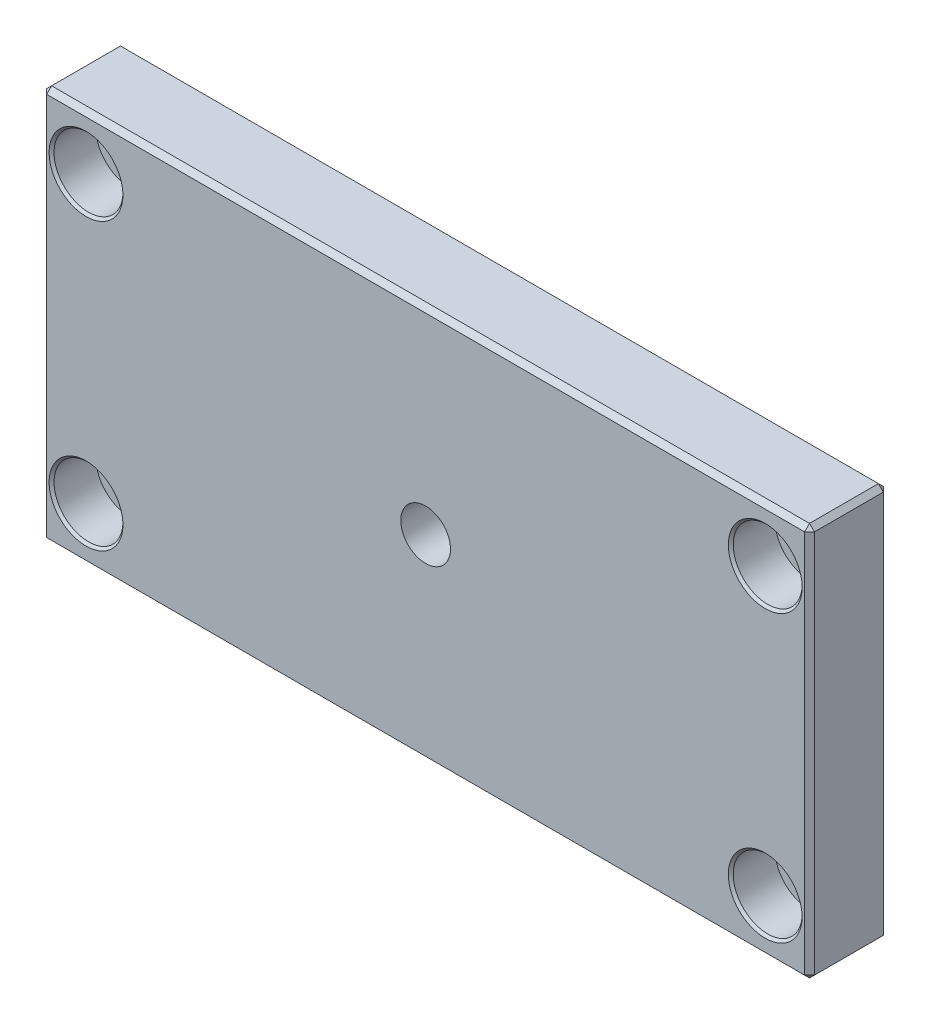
ISO-10303-21;
HEADER;
FILE_DESCRIPTION(('STEP AP214'),'2;1');
FILE_NAME('part.step','',(''),(''),'','','');
FILE_SCHEMA(('AUTOMOTIVE_DESIGN { 1 0 10303 214 1 1 1 1 }'));
ENDSEC;
DATA;
#1=APPLICATION_CONTEXT('core data for automotive mechanical design processes');
#2=APPLICATION_PROTOCOL_DEFINITION('international standard','automotive_design',2000,#1);
#3=PRODUCT_CONTEXT('',#1,'mechanical');
#4=PRODUCT('Part','Part','',(#3));
#5=PRODUCT_RELATED_PRODUCT_CATEGORY('part','',(#4));
#6=PRODUCT_DEFINITION_FORMATION('','',#4);
#7=PRODUCT_DEFINITION_CONTEXT('part definition',#1,'design');
#8=PRODUCT_DEFINITION('design','',#6,#7);
#9=PRODUCT_DEFINITION_SHAPE('','',#8);
#10=(LENGTH_UNIT() NAMED_UNIT(*) SI_UNIT(.MILLI.,.METRE.));
#11=(NAMED_UNIT(*) PLANE_ANGLE_UNIT() SI_UNIT($,.RADIAN.));
#12=(NAMED_UNIT(*) SI_UNIT($,.STERADIAN.) SOLID_ANGLE_UNIT());
#13=UNCERTAINTY_MEASURE_WITH_UNIT(LENGTH_MEASURE(1.E-05),#10,'distance_accuracy_value','');
#14=(GEOMETRIC_REPRESENTATION_CONTEXT(3) GLOBAL_UNCERTAINTY_ASSIGNED_CONTEXT((#13)) GLOBAL_UNIT_ASSIGNED_CONTEXT((#10,
#11,#12)) REPRESENTATION_CONTEXT('',''));
#15=CARTESIAN_POINT('',(0.,0.,0.));
#16=DIRECTION('',(0.,0.,1.));
#17=DIRECTION('',(1.,0.,0.));
#18=AXIS2_PLACEMENT_3D('',#15,#16,#17);
#19=CARTESIAN_POINT('',(0.499999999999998,0.5,15.));
#20=DIRECTION('',(-0.577350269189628,-0.577350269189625,0.577350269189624));
#21=DIRECTION('',(0.707106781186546,-0.707106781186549,0.));
#22=AXIS2_PLACEMENT_3D('',#19,#20,#21);
#23=PLANE('',#22);
#24=DIRECTION('',(0.707106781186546,0.,0.707106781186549));
#25=VECTOR('',#24,1.);
#26=CARTESIAN_POINT('',(0.499999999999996,1.,15.5));
#27=LINE('',#26,#25);
#28=CARTESIAN_POINT('',(0.,1.,15.));
#29=VERTEX_POINT('',#28);
#30=CARTESIAN_POINT('',(0.999999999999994,1.,16.));
#31=VERTEX_POINT('',#30);
#32=EDGE_CURVE('E122',#29,#31,#27,.T.);
#33=ORIENTED_EDGE('',*,*,#32,.F.);
#34=DIRECTION('',(0.707106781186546,-0.707106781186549,0.));
#35=VECTOR('',#34,1.);
#36=CARTESIAN_POINT('',(0.499999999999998,0.5,15.));
#37=LINE('',#36,#35);
#38=CARTESIAN_POINT('',(0.999999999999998,0.,15.));
#39=VERTEX_POINT('',#38);
#40=EDGE_CURVE('E105',#39,#29,#37,.F.);
#41=ORIENTED_EDGE('',*,*,#40,.F.);
#42=DIRECTION('',(0.,-0.707106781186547,-0.707106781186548));
#43=VECTOR('',#42,1.);
#44=CARTESIAN_POINT('',(1.,0.499999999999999,15.5));
#45=LINE('',#44,#43);
#46=EDGE_CURVE('E181',#31,#39,#45,.T.);
#47=ORIENTED_EDGE('',*,*,#46,.F.);
#48=EDGE_LOOP('',(#33,#41,#47));
#49=FACE_BOUND('',#48,.T.);
#50=ADVANCED_FACE('F17',(#49),#23,.T.);
#51=CARTESIAN_POINT('',(155.5,0.499999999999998,15.));
#52=DIRECTION('',(0.577350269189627,-0.577350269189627,0.577350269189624));
#53=DIRECTION('',(0.707106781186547,0.707106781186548,0.));
#54=AXIS2_PLACEMENT_3D('',#51,#52,#53);
#55=PLANE('',#54);
#56=DIRECTION('',(0.707106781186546,0.,-0.707106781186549));
#57=VECTOR('',#56,1.);
#58=CARTESIAN_POINT('',(155.5,1.,15.5));
#59=LINE('',#58,#57);
#60=CARTESIAN_POINT('',(155.,0.999999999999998,16.));
#61=VERTEX_POINT('',#60);
#62=CARTESIAN_POINT('',(156.,0.999999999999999,15.));
#63=VERTEX_POINT('',#62);
#64=EDGE_CURVE('E177',#61,#63,#59,.T.);
#65=ORIENTED_EDGE('',*,*,#64,.F.);
#66=DIRECTION('',(0.,-0.707106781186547,-0.707106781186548));
#67=VECTOR('',#66,1.);
#68=CARTESIAN_POINT('',(155.,0.499999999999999,15.5));
#69=LINE('',#68,#67);
#70=CARTESIAN_POINT('',(155.,0.,15.));
#71=VERTEX_POINT('',#70);
#72=EDGE_CURVE('E179',#71,#61,#69,.F.);
#73=ORIENTED_EDGE('',*,*,#72,.F.);
#74=DIRECTION('',(0.707106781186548,0.707106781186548,0.));
#75=VECTOR('',#74,1.);
#76=CARTESIAN_POINT('',(155.5,0.499999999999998,15.));
#77=LINE('',#76,#75);
#78=EDGE_CURVE('E187',#63,#71,#77,.F.);
#79=ORIENTED_EDGE('',*,*,#78,.F.);
#80=EDGE_LOOP('',(#65,#73,#79));
#81=FACE_BOUND('',#80,.T.);
#82=ADVANCED_FACE('F296',(#81),#55,.T.);
#83=CARTESIAN_POINT('',(155.5,79.5,15.));
#84=DIRECTION('',(0.577350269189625,0.577350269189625,0.577350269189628));
#85=DIRECTION('',(0.707106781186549,0.,-0.707106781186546));
#86=AXIS2_PLACEMENT_3D('',#83,#84,#85);
#87=PLANE('',#86);
#88=DIRECTION('',(0.,-0.707106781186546,0.707106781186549));
#89=VECTOR('',#88,1.);
#90=CARTESIAN_POINT('',(155.,79.5,15.5));
#91=LINE('',#90,#89);
#92=CARTESIAN_POINT('',(155.,79.,16.));
#93=VERTEX_POINT('',#92);
#94=CARTESIAN_POINT('',(155.,80.,15.));
#95=VERTEX_POINT('',#94);
#96=EDGE_CURVE('E173',#93,#95,#91,.F.);
#97=ORIENTED_EDGE('',*,*,#96,.F.);
#98=DIRECTION('',(0.707106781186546,0.,-0.707106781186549));
#99=VECTOR('',#98,1.);
#100=CARTESIAN_POINT('',(155.5,79.,15.5));
#101=LINE('',#100,#99);
#102=CARTESIAN_POINT('',(156.,79.,15.));
#103=VERTEX_POINT('',#102);
#104=EDGE_CURVE('E175',#103,#93,#101,.F.);
#105=ORIENTED_EDGE('',*,*,#104,.F.);
#106=DIRECTION('',(-0.707106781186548,0.707106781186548,0.));
#107=VECTOR('',#106,1.);
#108=CARTESIAN_POINT('',(155.5,79.5,15.));
#109=LINE('',#108,#107);
#110=EDGE_CURVE('E133',#95,#103,#109,.F.);
#111=ORIENTED_EDGE('',*,*,#110,.F.);
#112=EDGE_LOOP('',(#97,#105,#111));
#113=FACE_BOUND('',#112,.T.);
#114=ADVANCED_FACE('F495',(#113),#87,.T.);
#115=CARTESIAN_POINT('',(0.,79.,15.));
#116=DIRECTION('',(-0.577350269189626,0.577350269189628,0.577350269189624));
#117=DIRECTION('',(-0.707106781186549,-0.707106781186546,0.));
#118=AXIS2_PLACEMENT_3D('',#115,#116,#117);
#119=PLANE('',#118);
#120=DIRECTION('',(-0.707106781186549,-0.707106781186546,0.));
#121=VECTOR('',#120,1.);
#122=CARTESIAN_POINT('',(0.499999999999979,79.5,15.));
#123=LINE('',#122,#121);
#124=CARTESIAN_POINT('',(0.,79.,15.));
#125=VERTEX_POINT('',#124);
#126=CARTESIAN_POINT('',(0.999999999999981,80.,15.));
#127=VERTEX_POINT('',#126);
#128=EDGE_CURVE('E125',#125,#127,#123,.F.);
#129=ORIENTED_EDGE('',*,*,#128,.F.);
#130=DIRECTION('',(0.707106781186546,0.,0.707106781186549));
#131=VECTOR('',#130,1.);
#132=CARTESIAN_POINT('',(0.499999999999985,79.,15.5));
#133=LINE('',#132,#131);
#134=CARTESIAN_POINT('',(0.999999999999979,79.,16.));
#135=VERTEX_POINT('',#134);
#136=EDGE_CURVE('E112',#135,#125,#133,.F.);
#137=ORIENTED_EDGE('',*,*,#136,.F.);
#138=DIRECTION('',(0.,-0.707106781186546,0.707106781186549));
#139=VECTOR('',#138,1.);
#140=CARTESIAN_POINT('',(0.99999999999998,79.5,15.5));
#141=LINE('',#140,#139);
#142=EDGE_CURVE('E127',#127,#135,#141,.T.);
#143=ORIENTED_EDGE('',*,*,#142,.F.);
#144=EDGE_LOOP('',(#129,#137,#143));
#145=FACE_BOUND('',#144,.T.);
#146=ADVANCED_FACE('F126',(#145),#119,.T.);
#147=CARTESIAN_POINT('',(0.499999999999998,0.5,0.));
#148=DIRECTION('',(-0.707106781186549,-0.707106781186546,0.));
#149=DIRECTION('',(0.707106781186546,-0.707106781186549,0.));
#150=AXIS2_PLACEMENT_3D('',#147,#148,#149);
#151=PLANE('',#150);
#152=DIRECTION('',(0.707106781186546,-0.707106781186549,0.));
#153=VECTOR('',#152,1.);
#154=CARTESIAN_POINT('',(0.499999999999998,0.5,1.));
#155=LINE('',#154,#153);
#156=CARTESIAN_POINT('',(0.,1.,1.));
#157=VERTEX_POINT('',#156);
#158=CARTESIAN_POINT('',(0.999999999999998,0.,1.));
#159=VERTEX_POINT('',#158);
#160=EDGE_CURVE('E189',#157,#159,#155,.T.);
#161=ORIENTED_EDGE('',*,*,#160,.T.);
#162=DIRECTION('',(0.,0.,-1.));
#163=VECTOR('',#162,1.);
#164=CARTESIAN_POINT('',(1.,0.,0.));
#165=LINE('',#164,#163);
#166=EDGE_CURVE('E277',#39,#159,#165,.T.);
#167=ORIENTED_EDGE('',*,*,#166,.F.);
#168=ORIENTED_EDGE('',*,*,#40,.T.);
#169=DIRECTION('',(0.,0.,1.));
#170=VECTOR('',#169,1.);
#171=CARTESIAN_POINT('',(0.,1.,0.));
#172=LINE('',#171,#170);
#173=EDGE_CURVE('E141',#157,#29,#172,.T.);
#174=ORIENTED_EDGE('',*,*,#173,.F.);
#175=EDGE_LOOP('',(#161,#167,#168,#174));
#176=FACE_BOUND('',#175,.T.);
#177=ADVANCED_FACE('F304',(#176),#151,.T.);
#178=CARTESIAN_POINT('',(155.5,0.499999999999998,0.));
#179=DIRECTION('',(0.707106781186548,-0.707106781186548,0.));
#180=DIRECTION('',(0.707106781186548,0.707106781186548,0.));
#181=AXIS2_PLACEMENT_3D('',#178,#179,#180);
#182=PLANE('',#181);
#183=DIRECTION('',(0.707106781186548,0.707106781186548,0.));
#184=VECTOR('',#183,1.);
#185=CARTESIAN_POINT('',(155.5,0.499999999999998,1.));
#186=LINE('',#185,#184);
#187=CARTESIAN_POINT('',(155.,0.,1.));
#188=VERTEX_POINT('',#187);
#189=CARTESIAN_POINT('',(156.,0.999999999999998,1.));
#190=VERTEX_POINT('',#189);
#191=EDGE_CURVE('E134',#188,#190,#186,.T.);
#192=ORIENTED_EDGE('',*,*,#191,.T.);
#193=DIRECTION('',(0.,0.,-1.));
#194=VECTOR('',#193,1.);
#195=CARTESIAN_POINT('',(156.,1.,0.));
#196=LINE('',#195,#194);
#197=EDGE_CURVE('E268',#63,#190,#196,.T.);
#198=ORIENTED_EDGE('',*,*,#197,.F.);
#199=ORIENTED_EDGE('',*,*,#78,.T.);
#200=DIRECTION('',(0.,0.,-1.));
#201=VECTOR('',#200,1.);
#202=CARTESIAN_POINT('',(155.,0.,0.));
#203=LINE('',#202,#201);
#204=EDGE_CURVE('E143',#188,#71,#203,.F.);
#205=ORIENTED_EDGE('',*,*,#204,.F.);
#206=EDGE_LOOP('',(#192,#198,#199,#205));
#207=FACE_BOUND('',#206,.T.);
#208=ADVANCED_FACE('F488',(#207),#182,.T.);
#209=CARTESIAN_POINT('',(0.499999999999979,79.5,0.));
#210=DIRECTION('',(-0.707106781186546,0.707106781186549,0.));
#211=DIRECTION('',(-0.707106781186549,-0.707106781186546,0.));
#212=AXIS2_PLACEMENT_3D('',#209,#210,#211);
#213=PLANE('',#212);
#214=DIRECTION('',(-0.707106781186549,-0.707106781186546,0.));
#215=VECTOR('',#214,1.);
#216=CARTESIAN_POINT('',(0.749999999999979,79.75,0.999999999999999));
#217=LINE('',#216,#215);
#218=CARTESIAN_POINT('',(0.,79.,0.999999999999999));
#219=VERTEX_POINT('',#218);
#220=CARTESIAN_POINT('',(0.999999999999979,80.,1.));
#221=VERTEX_POINT('',#220);
#222=EDGE_CURVE('E147',#219,#221,#217,.F.);
#223=ORIENTED_EDGE('',*,*,#222,.F.);
#224=DIRECTION('',(0.,0.,1.));
#225=VECTOR('',#224,1.);
#226=CARTESIAN_POINT('',(0.,79.,0.));
#227=LINE('',#226,#225);
#228=EDGE_CURVE('E139',#125,#219,#227,.F.);
#229=ORIENTED_EDGE('',*,*,#228,.F.);
#230=ORIENTED_EDGE('',*,*,#128,.T.);
#231=DIRECTION('',(0.,0.,1.));
#232=VECTOR('',#231,1.);
#233=CARTESIAN_POINT('',(0.999999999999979,80.,0.));
#234=LINE('',#233,#232);
#235=EDGE_CURVE('E265',#221,#127,#234,.T.);
#236=ORIENTED_EDGE('',*,*,#235,.F.);
#237=EDGE_LOOP('',(#223,#229,#230,#236));
#238=FACE_BOUND('',#237,.T.);
#239=ADVANCED_FACE('F146',(#238),#213,.T.);
#240=CARTESIAN_POINT('',(155.5,79.5,0.));
#241=DIRECTION('',(0.707106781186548,0.707106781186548,0.));
#242=DIRECTION('',(-0.707106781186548,0.707106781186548,0.));
#243=AXIS2_PLACEMENT_3D('',#240,#241,#242);
#244=PLANE('',#243);
#245=DIRECTION('',(-0.707106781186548,0.707106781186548,0.));
#246=VECTOR('',#245,1.);
#247=CARTESIAN_POINT('',(155.5,79.5,1.));
#248=LINE('',#247,#246);
#249=CARTESIAN_POINT('',(156.,79.,1.));
#250=VERTEX_POINT('',#249);
#251=CARTESIAN_POINT('',(155.,80.,0.999999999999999));
#252=VERTEX_POINT('',#251);
#253=EDGE_CURVE('E123',#250,#252,#248,.T.);
#254=ORIENTED_EDGE('',*,*,#253,.T.);
#255=DIRECTION('',(0.,0.,1.));
#256=VECTOR('',#255,1.);
#257=CARTESIAN_POINT('',(155.,80.,0.));
#258=LINE('',#257,#256);
#259=EDGE_CURVE('E259',#95,#252,#258,.F.);
#260=ORIENTED_EDGE('',*,*,#259,.F.);
#261=ORIENTED_EDGE('',*,*,#110,.T.);
#262=DIRECTION('',(0.,0.,-1.));
#263=VECTOR('',#262,1.);
#264=CARTESIAN_POINT('',(156.,79.,0.));
#265=LINE('',#264,#263);
#266=EDGE_CURVE('E274',#250,#103,#265,.F.);
#267=ORIENTED_EDGE('',*,*,#266,.F.);
#268=EDGE_LOOP('',(#254,#260,#261,#267));
#269=FACE_BOUND('',#268,.T.);
#270=ADVANCED_FACE('F370',(#269),#244,.T.);
#271=CARTESIAN_POINT('',(0.499999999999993,20.,15.5));
#272=DIRECTION('',(-0.707106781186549,0.,0.707106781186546));
#273=DIRECTION('',(0.707106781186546,0.,0.707106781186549));
#274=AXIS2_PLACEMENT_3D('',#271,#272,#273);
#275=PLANE('',#274);
#276=ORIENTED_EDGE('',*,*,#32,.T.);
#277=DIRECTION('',(0.,1.,0.));
#278=VECTOR('',#277,1.);
#279=CARTESIAN_POINT('',(0.999999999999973,40.,16.));
#280=LINE('',#279,#278);
#281=EDGE_CURVE('E118',#135,#31,#280,.F.);
#282=ORIENTED_EDGE('',*,*,#281,.F.);
#283=ORIENTED_EDGE('',*,*,#136,.T.);
#284=DIRECTION('',(0.,1.,0.));
#285=VECTOR('',#284,1.);
#286=CARTESIAN_POINT('',(0.,0.,15.));
#287=LINE('',#286,#285);
#288=EDGE_CURVE('E116',#29,#125,#287,.T.);
#289=ORIENTED_EDGE('',*,*,#288,.F.);
#290=EDGE_LOOP('',(#276,#282,#283,#289));
#291=FACE_BOUND('',#290,.T.);
#292=ADVANCED_FACE('F114',(#291),#275,.T.);
#293=CARTESIAN_POINT('',(117.,0.499999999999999,15.5));
#294=DIRECTION('',(0.,-0.707106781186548,0.707106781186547));
#295=DIRECTION('',(0.,-0.707106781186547,-0.707106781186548));
#296=AXIS2_PLACEMENT_3D('',#293,#294,#295);
#297=PLANE('',#296);
#298=ORIENTED_EDGE('',*,*,#72,.T.);
#299=DIRECTION('',(1.,0.,0.));
#300=VECTOR('',#299,1.);
#301=CARTESIAN_POINT('',(78.,1.,16.));
#302=LINE('',#301,#300);
#303=EDGE_CURVE('E251',#31,#61,#302,.T.);
#304=ORIENTED_EDGE('',*,*,#303,.F.);
#305=ORIENTED_EDGE('',*,*,#46,.T.);
#306=DIRECTION('',(1.,0.,0.));
#307=VECTOR('',#306,1.);
#308=CARTESIAN_POINT('',(156.,0.,15.));
#309=LINE('',#308,#307);
#310=EDGE_CURVE('E280',#71,#39,#309,.F.);
#311=ORIENTED_EDGE('',*,*,#310,.F.);
#312=EDGE_LOOP('',(#298,#304,#305,#311));
#313=FACE_BOUND('',#312,.T.);
#314=ADVANCED_FACE('F301',(#313),#297,.T.);
#315=CARTESIAN_POINT('',(155.5,60.,15.5));
#316=DIRECTION('',(0.707106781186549,0.,0.707106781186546));
#317=DIRECTION('',(0.707106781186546,0.,-0.707106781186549));
#318=AXIS2_PLACEMENT_3D('',#315,#316,#317);
#319=PLANE('',#318);
#320=ORIENTED_EDGE('',*,*,#104,.T.);
#321=DIRECTION('',(0.,1.,0.));
#322=VECTOR('',#321,1.);
#323=CARTESIAN_POINT('',(155.,40.,16.));
#324=LINE('',#323,#322);
#325=EDGE_CURVE('E246',#61,#93,#324,.T.);
#326=ORIENTED_EDGE('',*,*,#325,.F.);
#327=ORIENTED_EDGE('',*,*,#64,.T.);
#328=DIRECTION('',(0.,1.,0.));
#329=VECTOR('',#328,1.);
#330=CARTESIAN_POINT('',(156.,80.,15.));
#331=LINE('',#330,#329);
#332=EDGE_CURVE('E271',#103,#63,#331,.F.);
#333=ORIENTED_EDGE('',*,*,#332,.F.);
#334=EDGE_LOOP('',(#320,#326,#327,#333));
#335=FACE_BOUND('',#334,.T.);
#336=ADVANCED_FACE('F475',(#335),#319,.T.);
#337=CARTESIAN_POINT('',(39.,79.5,15.5));
#338=DIRECTION('',(0.,0.707106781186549,0.707106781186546));
#339=DIRECTION('',(0.,-0.707106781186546,0.707106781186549));
#340=AXIS2_PLACEMENT_3D('',#337,#338,#339);
#341=PLANE('',#340);
#342=ORIENTED_EDGE('',*,*,#142,.T.);
#343=DIRECTION('',(1.,0.,0.));
#344=VECTOR('',#343,1.);
#345=CARTESIAN_POINT('',(78.,79.,16.));
#346=LINE('',#345,#344);
#347=EDGE_CURVE('E243',#93,#135,#346,.F.);
#348=ORIENTED_EDGE('',*,*,#347,.F.);
#349=ORIENTED_EDGE('',*,*,#96,.T.);
#350=DIRECTION('',(1.,0.,0.));
#351=VECTOR('',#350,1.);
#352=CARTESIAN_POINT('',(0.,80.,15.));
#353=LINE('',#352,#351);
#354=EDGE_CURVE('E262',#127,#95,#353,.T.);
#355=ORIENTED_EDGE('',*,*,#354,.F.);
#356=EDGE_LOOP('',(#342,#348,#349,#355));
#357=FACE_BOUND('',#356,.T.);
#358=ADVANCED_FACE('F471',(#357),#341,.T.);
#359=CARTESIAN_POINT('',(147.,11.,16.0000000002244));
#360=DIRECTION('',(0.,0.,1.));
#361=DIRECTION('',(1.,0.,0.));
#362=AXIS2_PLACEMENT_3D('',#359,#360,#361);
#363=CONICAL_SURFACE('',#362,7.49999999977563,0.785398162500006);
#364=CARTESIAN_POINT('',(147.,11.,16.0000000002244));
#365=DIRECTION('',(0.,0.,1.));
#366=DIRECTION('',(1.,0.,0.));
#367=AXIS2_PLACEMENT_3D('',#364,#365,#366);
#368=CIRCLE('',#367,7.49999999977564);
#369=CARTESIAN_POINT('',(154.499999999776,11.,16.0000000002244));
#370=VERTEX_POINT('',#369);
#371=EDGE_CURVE('E20',#370,#370,#368,.F.);
#372=ORIENTED_EDGE('',*,*,#371,.F.);
#373=EDGE_LOOP('',(#372));
#374=FACE_BOUND('',#373,.T.);
#375=CARTESIAN_POINT('',(147.,11.,15.5));
#376=DIRECTION('',(0.,0.,1.));
#377=DIRECTION('',(1.,0.,0.));
#378=AXIS2_PLACEMENT_3D('',#375,#376,#377);
#379=CIRCLE('',#378,7.);
#380=CARTESIAN_POINT('',(154.,11.,15.5));
#381=VERTEX_POINT('',#380);
#382=EDGE_CURVE('E165',#381,#381,#379,.F.);
#383=ORIENTED_EDGE('',*,*,#382,.T.);
#384=EDGE_LOOP('',(#383));
#385=FACE_BOUND('',#384,.T.);
#386=ADVANCED_FACE('F467',(#374,#385),#363,.F.);
#387=CARTESIAN_POINT('',(9.00000000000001,11.,16.0000000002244));
#388=DIRECTION('',(0.,0.,1.));
#389=DIRECTION('',(1.,0.,0.));
#390=AXIS2_PLACEMENT_3D('',#387,#388,#389);
#391=CONICAL_SURFACE('',#390,7.49999999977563,0.785398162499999);
#392=CARTESIAN_POINT('',(9.00000000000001,11.,16.0000000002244));
#393=DIRECTION('',(0.,0.,1.));
#394=DIRECTION('',(1.,0.,0.));
#395=AXIS2_PLACEMENT_3D('',#392,#393,#394);
#396=CIRCLE('',#395,7.49999999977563);
#397=CARTESIAN_POINT('',(16.4999999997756,11.,16.0000000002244));
#398=VERTEX_POINT('',#397);
#399=EDGE_CURVE('E238',#398,#398,#396,.F.);
#400=ORIENTED_EDGE('',*,*,#399,.F.);
#401=EDGE_LOOP('',(#400));
#402=FACE_BOUND('',#401,.T.);
#403=CARTESIAN_POINT('',(9.00000000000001,11.,15.5));
#404=DIRECTION('',(0.,0.,1.));
#405=DIRECTION('',(1.,0.,0.));
#406=AXIS2_PLACEMENT_3D('',#403,#404,#405);
#407=CIRCLE('',#406,7.);
#408=CARTESIAN_POINT('',(16.,11.,15.5));
#409=VERTEX_POINT('',#408);
#410=EDGE_CURVE('E149',#409,#409,#407,.F.);
#411=ORIENTED_EDGE('',*,*,#410,.T.);
#412=EDGE_LOOP('',(#411));
#413=FACE_BOUND('',#412,.T.);
#414=ADVANCED_FACE('F463',(#402,#413),#391,.F.);
#415=CARTESIAN_POINT('',(147.,69.,16.0000000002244));
#416=DIRECTION('',(0.,0.,1.));
#417=DIRECTION('',(1.,0.,0.));
#418=AXIS2_PLACEMENT_3D('',#415,#416,#417);
#419=CONICAL_SURFACE('',#418,7.49999999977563,0.785398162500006);
#420=CARTESIAN_POINT('',(147.,69.,16.0000000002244));
#421=DIRECTION('',(0.,0.,1.));
#422=DIRECTION('',(1.,0.,0.));
#423=AXIS2_PLACEMENT_3D('',#420,#421,#422);
#424=CIRCLE('',#423,7.49999999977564);
#425=CARTESIAN_POINT('',(154.499999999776,69.,16.0000000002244));
#426=VERTEX_POINT('',#425);
#427=EDGE_CURVE('E236',#426,#426,#424,.F.);
#428=ORIENTED_EDGE('',*,*,#427,.F.);
#429=EDGE_LOOP('',(#428));
#430=FACE_BOUND('',#429,.T.);
#431=CARTESIAN_POINT('',(147.,69.,15.5));
#432=DIRECTION('',(0.,0.,1.));
#433=DIRECTION('',(1.,0.,0.));
#434=AXIS2_PLACEMENT_3D('',#431,#432,#433);
#435=CIRCLE('',#434,7.);
#436=CARTESIAN_POINT('',(154.,69.,15.5));
#437=VERTEX_POINT('',#436);
#438=EDGE_CURVE('E153',#437,#437,#435,.F.);
#439=ORIENTED_EDGE('',*,*,#438,.T.);
#440=EDGE_LOOP('',(#439));
#441=FACE_BOUND('',#440,.T.);
#442=ADVANCED_FACE('F455',(#430,#441),#419,.F.);
#443=CARTESIAN_POINT('',(9.00000000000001,69.,16.0000000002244));
#444=DIRECTION('',(0.,0.,1.));
#445=DIRECTION('',(1.,0.,0.));
#446=AXIS2_PLACEMENT_3D('',#443,#444,#445);
#447=CONICAL_SURFACE('',#446,7.49999999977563,0.785398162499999);
#448=CARTESIAN_POINT('',(9.00000000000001,69.,16.0000000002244));
#449=DIRECTION('',(0.,0.,1.));
#450=DIRECTION('',(1.,0.,0.));
#451=AXIS2_PLACEMENT_3D('',#448,#449,#450);
#452=CIRCLE('',#451,7.49999999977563);
#453=CARTESIAN_POINT('',(16.4999999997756,69.,16.0000000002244));
#454=VERTEX_POINT('',#453);
#455=EDGE_CURVE('E233',#454,#454,#452,.F.);
#456=ORIENTED_EDGE('',*,*,#455,.F.);
#457=EDGE_LOOP('',(#456));
#458=FACE_BOUND('',#457,.T.);
#459=CARTESIAN_POINT('',(9.00000000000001,69.,15.5));
#460=DIRECTION('',(0.,0.,1.));
#461=DIRECTION('',(1.,0.,0.));
#462=AXIS2_PLACEMENT_3D('',#459,#460,#461);
#463=CIRCLE('',#462,7.);
#464=CARTESIAN_POINT('',(16.,69.,15.5));
#465=VERTEX_POINT('',#464);
#466=EDGE_CURVE('E160',#465,#465,#463,.F.);
#467=ORIENTED_EDGE('',*,*,#466,.T.);
#468=EDGE_LOOP('',(#467));
#469=FACE_BOUND('',#468,.T.);
#470=ADVANCED_FACE('F445',(#458,#469),#447,.F.);
#471=CARTESIAN_POINT('',(147.,11.,11.5));
#472=DIRECTION('',(0.,0.,1.));
#473=DIRECTION('',(1.,0.,0.));
#474=AXIS2_PLACEMENT_3D('',#471,#472,#473);
#475=CYLINDRICAL_SURFACE('',#474,7.);
#476=ORIENTED_EDGE('',*,*,#382,.F.);
#477=EDGE_LOOP('',(#476));
#478=FACE_BOUND('',#477,.T.);
#479=CARTESIAN_POINT('',(147.,11.,7.));
#480=DIRECTION('',(0.,0.,1.));
#481=DIRECTION('',(1.,0.,0.));
#482=AXIS2_PLACEMENT_3D('',#479,#480,#481);
#483=CIRCLE('',#482,7.);
#484=CARTESIAN_POINT('',(154.,11.,7.));
#485=VERTEX_POINT('',#484);
#486=EDGE_CURVE('E230',#485,#485,#483,.T.);
#487=ORIENTED_EDGE('',*,*,#486,.F.);
#488=EDGE_LOOP('',(#487));
#489=FACE_BOUND('',#488,.T.);
#490=ADVANCED_FACE('F442',(#478,#489),#475,.F.);
#491=CARTESIAN_POINT('',(9.00000000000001,69.,11.5));
#492=DIRECTION('',(0.,0.,1.));
#493=DIRECTION('',(1.,0.,0.));
#494=AXIS2_PLACEMENT_3D('',#491,#492,#493);
#495=CYLINDRICAL_SURFACE('',#494,7.);
#496=ORIENTED_EDGE('',*,*,#466,.F.);
#497=EDGE_LOOP('',(#496));
#498=FACE_BOUND('',#497,.T.);
#499=CARTESIAN_POINT('',(9.00000000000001,69.,7.));
#500=DIRECTION('',(0.,0.,1.));
#501=DIRECTION('',(1.,0.,0.));
#502=AXIS2_PLACEMENT_3D('',#499,#500,#501);
#503=CIRCLE('',#502,7.);
#504=CARTESIAN_POINT('',(16.,69.,7.));
#505=VERTEX_POINT('',#504);
#506=EDGE_CURVE('E227',#505,#505,#503,.T.);
#507=ORIENTED_EDGE('',*,*,#506,.F.);
#508=EDGE_LOOP('',(#507));
#509=FACE_BOUND('',#508,.T.);
#510=ADVANCED_FACE('F444',(#498,#509),#495,.F.);
#511=CARTESIAN_POINT('',(147.,69.,11.5));
#512=DIRECTION('',(0.,0.,1.));
#513=DIRECTION('',(1.,0.,0.));
#514=AXIS2_PLACEMENT_3D('',#511,#512,#513);
#515=CYLINDRICAL_SURFACE('',#514,7.);
#516=ORIENTED_EDGE('',*,*,#438,.F.);
#517=EDGE_LOOP('',(#516));
#518=FACE_BOUND('',#517,.T.);
#519=CARTESIAN_POINT('',(147.,69.,7.));
#520=DIRECTION('',(0.,0.,1.));
#521=DIRECTION('',(1.,0.,0.));
#522=AXIS2_PLACEMENT_3D('',#519,#520,#521);
#523=CIRCLE('',#522,7.);
#524=CARTESIAN_POINT('',(154.,69.,7.));
#525=VERTEX_POINT('',#524);
#526=EDGE_CURVE('E224',#525,#525,#523,.T.);
#527=ORIENTED_EDGE('',*,*,#526,.F.);
#528=EDGE_LOOP('',(#527));
#529=FACE_BOUND('',#528,.T.);
#530=ADVANCED_FACE('F452',(#518,#529),#515,.F.);
#531=CARTESIAN_POINT('',(9.00000000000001,11.,11.5));
#532=DIRECTION('',(0.,0.,1.));
#533=DIRECTION('',(1.,0.,0.));
#534=AXIS2_PLACEMENT_3D('',#531,#532,#533);
#535=CYLINDRICAL_SURFACE('',#534,7.);
#536=ORIENTED_EDGE('',*,*,#410,.F.);
#537=EDGE_LOOP('',(#536));
#538=FACE_BOUND('',#537,.T.);
#539=CARTESIAN_POINT('',(9.00000000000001,11.,7.));
#540=DIRECTION('',(0.,0.,1.));
#541=DIRECTION('',(1.,0.,0.));
#542=AXIS2_PLACEMENT_3D('',#539,#540,#541);
#543=CIRCLE('',#542,7.);
#544=CARTESIAN_POINT('',(16.,11.,7.));
#545=VERTEX_POINT('',#544);
#546=EDGE_CURVE('E220',#545,#545,#543,.T.);
#547=ORIENTED_EDGE('',*,*,#546,.F.);
#548=EDGE_LOOP('',(#547));
#549=FACE_BOUND('',#548,.T.);
#550=ADVANCED_FACE('F580',(#538,#549),#535,.F.);
#551=CARTESIAN_POINT('',(0.,0.,0.));
#552=DIRECTION('',(-1.,0.,0.));
#553=DIRECTION('',(0.,0.,1.));
#554=AXIS2_PLACEMENT_3D('',#551,#552,#553);
#555=PLANE('',#554);
#556=ORIENTED_EDGE('',*,*,#173,.T.);
#557=ORIENTED_EDGE('',*,*,#288,.T.);
#558=ORIENTED_EDGE('',*,*,#228,.T.);
#559=DIRECTION('',(0.,1.,0.));
#560=VECTOR('',#559,1.);
#561=CARTESIAN_POINT('',(0.,20.,0.999999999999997));
#562=LINE('',#561,#560);
#563=EDGE_CURVE('E328',#157,#219,#562,.T.);
#564=ORIENTED_EDGE('',*,*,#563,.F.);
#565=EDGE_LOOP('',(#556,#557,#558,#564));
#566=FACE_BOUND('',#565,.T.);
#567=ADVANCED_FACE('F137',(#566),#555,.T.);
#568=CARTESIAN_POINT('',(156.,0.,0.));
#569=DIRECTION('',(0.,-1.,0.));
#570=DIRECTION('',(0.,0.,-1.));
#571=AXIS2_PLACEMENT_3D('',#568,#569,#570);
#572=PLANE('',#571);
#573=ORIENTED_EDGE('',*,*,#310,.T.);
#574=ORIENTED_EDGE('',*,*,#166,.T.);
#575=DIRECTION('',(1.,0.,0.));
#576=VECTOR('',#575,1.);
#577=CARTESIAN_POINT('',(117.,0.,1.));
#578=LINE('',#577,#576);
#579=EDGE_CURVE('E291',#188,#159,#578,.F.);
#580=ORIENTED_EDGE('',*,*,#579,.F.);
#581=ORIENTED_EDGE('',*,*,#204,.T.);
#582=EDGE_LOOP('',(#573,#574,#580,#581));
#583=FACE_BOUND('',#582,.T.);
#584=ADVANCED_FACE('F288',(#583),#572,.T.);
#585=CARTESIAN_POINT('',(0.999999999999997,0.499999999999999,0.5));
#586=DIRECTION('',(-0.577350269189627,-0.577350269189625,-0.577350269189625));
#587=DIRECTION('',(-0.707106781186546,0.,0.707106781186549));
#588=AXIS2_PLACEMENT_3D('',#585,#586,#587);
#589=PLANE('',#588);
#590=DIRECTION('',(-0.707106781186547,0.,0.707106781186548));
#591=VECTOR('',#590,1.);
#592=CARTESIAN_POINT('',(0.499999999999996,0.999999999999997,0.500000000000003));
#593=LINE('',#592,#591);
#594=CARTESIAN_POINT('',(0.999999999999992,1.,0.));
#595=VERTEX_POINT('',#594);
#596=EDGE_CURVE('E223',#595,#157,#593,.T.);
#597=ORIENTED_EDGE('',*,*,#596,.F.);
#598=DIRECTION('',(0.,0.707106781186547,-0.707106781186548));
#599=VECTOR('',#598,1.);
#600=CARTESIAN_POINT('',(1.,0.499999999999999,0.5));
#601=LINE('',#600,#599);
#602=EDGE_CURVE('E310',#159,#595,#601,.T.);
#603=ORIENTED_EDGE('',*,*,#602,.F.);
#604=ORIENTED_EDGE('',*,*,#160,.F.);
#605=EDGE_LOOP('',(#597,#603,#604));
#606=FACE_BOUND('',#605,.T.);
#607=ADVANCED_FACE('F316',(#606),#589,.T.);
#608=CARTESIAN_POINT('',(156.,80.,0.));
#609=DIRECTION('',(1.,0.,0.));
#610=DIRECTION('',(0.,0.,-1.));
#611=AXIS2_PLACEMENT_3D('',#608,#609,#610);
#612=PLANE('',#611);
#613=ORIENTED_EDGE('',*,*,#332,.T.);
#614=ORIENTED_EDGE('',*,*,#197,.T.);
#615=DIRECTION('',(0.,1.,0.));
#616=VECTOR('',#615,1.);
#617=CARTESIAN_POINT('',(156.,60.,1.));
#618=LINE('',#617,#616);
#619=EDGE_CURVE('E322',#250,#190,#618,.F.);
#620=ORIENTED_EDGE('',*,*,#619,.F.);
#621=ORIENTED_EDGE('',*,*,#266,.T.);
#622=EDGE_LOOP('',(#613,#614,#620,#621));
#623=FACE_BOUND('',#622,.T.);
#624=ADVANCED_FACE('F606',(#623),#612,.T.);
#625=CARTESIAN_POINT('',(155.,0.999999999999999,0.));
#626=DIRECTION('',(0.577350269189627,-0.577350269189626,-0.577350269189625));
#627=DIRECTION('',(0.707106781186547,0.707106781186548,0.));
#628=AXIS2_PLACEMENT_3D('',#625,#626,#627);
#629=PLANE('',#628);
#630=DIRECTION('',(0.,0.707106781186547,-0.707106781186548));
#631=VECTOR('',#630,1.);
#632=CARTESIAN_POINT('',(155.,0.499999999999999,0.5));
#633=LINE('',#632,#631);
#634=CARTESIAN_POINT('',(155.,0.999999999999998,0.));
#635=VERTEX_POINT('',#634);
#636=EDGE_CURVE('E313',#635,#188,#633,.F.);
#637=ORIENTED_EDGE('',*,*,#636,.F.);
#638=DIRECTION('',(-0.707106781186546,0.,-0.707106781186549));
#639=VECTOR('',#638,1.);
#640=CARTESIAN_POINT('',(155.5,0.999999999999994,0.5));
#641=LINE('',#640,#639);
#642=EDGE_CURVE('E348',#190,#635,#641,.T.);
#643=ORIENTED_EDGE('',*,*,#642,.F.);
#644=ORIENTED_EDGE('',*,*,#191,.F.);
#645=EDGE_LOOP('',(#637,#643,#644));
#646=FACE_BOUND('',#645,.T.);
#647=ADVANCED_FACE('F358',(#646),#629,.T.);
#648=CARTESIAN_POINT('',(0.999999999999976,79.5,0.5));
#649=DIRECTION('',(-0.577350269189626,0.577350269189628,-0.577350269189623));
#650=DIRECTION('',(-0.707106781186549,-0.707106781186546,0.));
#651=AXIS2_PLACEMENT_3D('',#648,#649,#650);
#652=PLANE('',#651);
#653=ORIENTED_EDGE('',*,*,#222,.T.);
#654=DIRECTION('',(0.,0.707106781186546,0.707106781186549));
#655=VECTOR('',#654,1.);
#656=CARTESIAN_POINT('',(0.999999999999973,79.5,0.500000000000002));
#657=LINE('',#656,#655);
#658=CARTESIAN_POINT('',(0.999999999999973,79.,0.));
#659=VERTEX_POINT('',#658);
#660=EDGE_CURVE('E345',#659,#221,#657,.T.);
#661=ORIENTED_EDGE('',*,*,#660,.F.);
#662=DIRECTION('',(-0.707106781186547,0.,0.707106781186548));
#663=VECTOR('',#662,1.);
#664=CARTESIAN_POINT('',(0.499999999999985,79.,0.499999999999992));
#665=LINE('',#664,#663);
#666=EDGE_CURVE('E327',#219,#659,#665,.F.);
#667=ORIENTED_EDGE('',*,*,#666,.F.);
#668=EDGE_LOOP('',(#653,#661,#667));
#669=FACE_BOUND('',#668,.T.);
#670=ADVANCED_FACE('F384',(#669),#652,.T.);
#671=CARTESIAN_POINT('',(0.,80.,0.));
#672=DIRECTION('',(0.,1.,0.));
#673=DIRECTION('',(0.,0.,1.));
#674=AXIS2_PLACEMENT_3D('',#671,#672,#673);
#675=PLANE('',#674);
#676=ORIENTED_EDGE('',*,*,#259,.T.);
#677=DIRECTION('',(1.,0.,0.));
#678=VECTOR('',#677,1.);
#679=CARTESIAN_POINT('',(39.,80.,1.));
#680=LINE('',#679,#678);
#681=EDGE_CURVE('E343',#221,#252,#680,.T.);
#682=ORIENTED_EDGE('',*,*,#681,.F.);
#683=ORIENTED_EDGE('',*,*,#235,.T.);
#684=ORIENTED_EDGE('',*,*,#354,.T.);
#685=EDGE_LOOP('',(#676,#682,#683,#684));
#686=FACE_BOUND('',#685,.T.);
#687=ADVANCED_FACE('F366',(#686),#675,.T.);
#688=CARTESIAN_POINT('',(155.5,79.,0.5));
#689=DIRECTION('',(0.577350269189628,0.577350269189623,-0.577350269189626));
#690=DIRECTION('',(-0.707106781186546,0.,-0.707106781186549));
#691=AXIS2_PLACEMENT_3D('',#688,#689,#690);
#692=PLANE('',#691);
#693=DIRECTION('',(0.,0.707106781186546,0.707106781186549));
#694=VECTOR('',#693,1.);
#695=CARTESIAN_POINT('',(155.,79.5,0.499999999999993));
#696=LINE('',#695,#694);
#697=CARTESIAN_POINT('',(155.,79.,0.));
#698=VERTEX_POINT('',#697);
#699=EDGE_CURVE('E35',#252,#698,#696,.F.);
#700=ORIENTED_EDGE('',*,*,#699,.F.);
#701=ORIENTED_EDGE('',*,*,#253,.F.);
#702=DIRECTION('',(-0.707106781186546,0.,-0.707106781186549));
#703=VECTOR('',#702,1.);
#704=CARTESIAN_POINT('',(155.5,79.,0.5));
#705=LINE('',#704,#703);
#706=EDGE_CURVE('E319',#698,#250,#705,.F.);
#707=ORIENTED_EDGE('',*,*,#706,.F.);
#708=EDGE_LOOP('',(#700,#701,#707));
#709=FACE_BOUND('',#708,.T.);
#710=ADVANCED_FACE('F372',(#709),#692,.T.);
#711=CARTESIAN_POINT('',(78.,40.,16.));
#712=DIRECTION('',(0.,0.,1.));
#713=DIRECTION('',(1.,0.,0.));
#714=AXIS2_PLACEMENT_3D('',#711,#712,#713);
#715=PLANE('',#714);
#716=ORIENTED_EDGE('',*,*,#455,.T.);
#717=EDGE_LOOP('',(#716));
#718=FACE_BOUND('',#717,.T.);
#719=ORIENTED_EDGE('',*,*,#427,.T.);
#720=EDGE_LOOP('',(#719));
#721=FACE_BOUND('',#720,.T.);
#722=ORIENTED_EDGE('',*,*,#399,.T.);
#723=EDGE_LOOP('',(#722));
#724=FACE_BOUND('',#723,.T.);
#725=ORIENTED_EDGE('',*,*,#371,.T.);
#726=EDGE_LOOP('',(#725));
#727=FACE_BOUND('',#726,.T.);
#728=CARTESIAN_POINT('',(78.,40.,16.));
#729=DIRECTION('',(0.,0.,1.));
#730=DIRECTION('',(1.,0.,0.));
#731=AXIS2_PLACEMENT_3D('',#728,#729,#730);
#732=CIRCLE('',#731,5.053);
#733=CARTESIAN_POINT('',(83.053,40.,16.));
#734=VERTEX_POINT('',#733);
#735=EDGE_CURVE('E217',#734,#734,#732,.F.);
#736=ORIENTED_EDGE('',*,*,#735,.T.);
#737=EDGE_LOOP('',(#736));
#738=FACE_BOUND('',#737,.T.);
#739=ORIENTED_EDGE('',*,*,#325,.T.);
#740=ORIENTED_EDGE('',*,*,#347,.T.);
#741=ORIENTED_EDGE('',*,*,#281,.T.);
#742=ORIENTED_EDGE('',*,*,#303,.T.);
#743=EDGE_LOOP('',(#739,#740,#741,#742));
#744=FACE_BOUND('',#743,.T.);
#745=ADVANCED_FACE('F374',(#718,#721,#724,#727,#738,#744),#715,.T.);
#746=CARTESIAN_POINT('',(147.,11.,7.));
#747=DIRECTION('',(0.,0.,1.));
#748=DIRECTION('',(1.,0.,0.));
#749=AXIS2_PLACEMENT_3D('',#746,#747,#748);
#750=PLANE('',#749);
#751=CARTESIAN_POINT('',(147.,11.,7.00000000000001));
#752=DIRECTION('',(0.,0.,1.));
#753=DIRECTION('',(1.,0.,0.));
#754=AXIS2_PLACEMENT_3D('',#751,#752,#753);
#755=CIRCLE('',#754,4.25);
#756=CARTESIAN_POINT('',(151.25,11.,7.00000000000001));
#757=VERTEX_POINT('',#756);
#758=EDGE_CURVE('E214',#757,#757,#755,.F.);
#759=ORIENTED_EDGE('',*,*,#758,.T.);
#760=EDGE_LOOP('',(#759));
#761=FACE_BOUND('',#760,.T.);
#762=ORIENTED_EDGE('',*,*,#486,.T.);
#763=EDGE_LOOP('',(#762));
#764=FACE_BOUND('',#763,.T.);
#765=ADVANCED_FACE('F381',(#761,#764),#750,.T.);
#766=CARTESIAN_POINT('',(9.00000000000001,69.,7.));
#767=DIRECTION('',(0.,0.,1.));
#768=DIRECTION('',(1.,0.,0.));
#769=AXIS2_PLACEMENT_3D('',#766,#767,#768);
#770=PLANE('',#769);
#771=CARTESIAN_POINT('',(9.00000000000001,69.,7.00000000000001));
#772=DIRECTION('',(0.,0.,1.));
#773=DIRECTION('',(1.,0.,0.));
#774=AXIS2_PLACEMENT_3D('',#771,#772,#773);
#775=CIRCLE('',#774,4.25);
#776=CARTESIAN_POINT('',(13.25,69.,7.00000000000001));
#777=VERTEX_POINT('',#776);
#778=EDGE_CURVE('E211',#777,#777,#775,.F.);
#779=ORIENTED_EDGE('',*,*,#778,.T.);
#780=EDGE_LOOP('',(#779));
#781=FACE_BOUND('',#780,.T.);
#782=ORIENTED_EDGE('',*,*,#506,.T.);
#783=EDGE_LOOP('',(#782));
#784=FACE_BOUND('',#783,.T.);
#785=ADVANCED_FACE('F429',(#781,#784),#770,.T.);
#786=CARTESIAN_POINT('',(147.,69.,7.));
#787=DIRECTION('',(0.,0.,1.));
#788=DIRECTION('',(1.,0.,0.));
#789=AXIS2_PLACEMENT_3D('',#786,#787,#788);
#790=PLANE('',#789);
#791=CARTESIAN_POINT('',(147.,69.,7.00000000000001));
#792=DIRECTION('',(0.,0.,1.));
#793=DIRECTION('',(1.,0.,0.));
#794=AXIS2_PLACEMENT_3D('',#791,#792,#793);
#795=CIRCLE('',#794,4.25);
#796=CARTESIAN_POINT('',(151.25,69.,7.00000000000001));
#797=VERTEX_POINT('',#796);
#798=EDGE_CURVE('E208',#797,#797,#795,.F.);
#799=ORIENTED_EDGE('',*,*,#798,.T.);
#800=EDGE_LOOP('',(#799));
#801=FACE_BOUND('',#800,.T.);
#802=ORIENTED_EDGE('',*,*,#526,.T.);
#803=EDGE_LOOP('',(#802));
#804=FACE_BOUND('',#803,.T.);
#805=ADVANCED_FACE('F425',(#801,#804),#790,.T.);
#806=CARTESIAN_POINT('',(9.00000000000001,11.,7.));
#807=DIRECTION('',(0.,0.,1.));
#808=DIRECTION('',(1.,0.,0.));
#809=AXIS2_PLACEMENT_3D('',#806,#807,#808);
#810=PLANE('',#809);
#811=CARTESIAN_POINT('',(9.00000000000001,11.,7.00000000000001));
#812=DIRECTION('',(0.,0.,1.));
#813=DIRECTION('',(1.,0.,0.));
#814=AXIS2_PLACEMENT_3D('',#811,#812,#813);
#815=CIRCLE('',#814,4.25);
#816=CARTESIAN_POINT('',(13.25,11.,7.00000000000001));
#817=VERTEX_POINT('',#816);
#818=EDGE_CURVE('E204',#817,#817,#815,.F.);
#819=ORIENTED_EDGE('',*,*,#818,.T.);
#820=EDGE_LOOP('',(#819));
#821=FACE_BOUND('',#820,.T.);
#822=ORIENTED_EDGE('',*,*,#546,.T.);
#823=EDGE_LOOP('',(#822));
#824=FACE_BOUND('',#823,.T.);
#825=ADVANCED_FACE('F422',(#821,#824),#810,.T.);
#826=CARTESIAN_POINT('',(0.499999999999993,20.,0.5));
#827=DIRECTION('',(-0.707106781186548,0.,-0.707106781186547));
#828=DIRECTION('',(-0.707106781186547,0.,0.707106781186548));
#829=AXIS2_PLACEMENT_3D('',#826,#827,#828);
#830=PLANE('',#829);
#831=ORIENTED_EDGE('',*,*,#666,.T.);
#832=DIRECTION('',(0.,1.,0.));
#833=VECTOR('',#832,1.);
#834=CARTESIAN_POINT('',(0.999999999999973,40.,0.));
#835=LINE('',#834,#833);
#836=EDGE_CURVE('E207',#659,#595,#835,.F.);
#837=ORIENTED_EDGE('',*,*,#836,.T.);
#838=ORIENTED_EDGE('',*,*,#596,.T.);
#839=ORIENTED_EDGE('',*,*,#563,.T.);
#840=EDGE_LOOP('',(#831,#837,#838,#839));
#841=FACE_BOUND('',#840,.T.);
#842=ADVANCED_FACE('F331',(#841),#830,.T.);
#843=CARTESIAN_POINT('',(117.,0.499999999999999,0.5));
#844=DIRECTION('',(0.,-0.707106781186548,-0.707106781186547));
#845=DIRECTION('',(0.,0.707106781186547,-0.707106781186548));
#846=AXIS2_PLACEMENT_3D('',#843,#844,#845);
#847=PLANE('',#846);
#848=ORIENTED_EDGE('',*,*,#602,.T.);
#849=DIRECTION('',(1.,0.,0.));
#850=VECTOR('',#849,1.);
#851=CARTESIAN_POINT('',(78.,1.,0.));
#852=LINE('',#851,#850);
#853=EDGE_CURVE('E336',#595,#635,#852,.T.);
#854=ORIENTED_EDGE('',*,*,#853,.T.);
#855=ORIENTED_EDGE('',*,*,#636,.T.);
#856=ORIENTED_EDGE('',*,*,#579,.T.);
#857=EDGE_LOOP('',(#848,#854,#855,#856));
#858=FACE_BOUND('',#857,.T.);
#859=ADVANCED_FACE('F308',(#858),#847,.T.);
#860=CARTESIAN_POINT('',(155.5,60.,0.5));
#861=DIRECTION('',(0.707106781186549,0.,-0.707106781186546));
#862=DIRECTION('',(-0.707106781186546,0.,-0.707106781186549));
#863=AXIS2_PLACEMENT_3D('',#860,#861,#862);
#864=PLANE('',#863);
#865=ORIENTED_EDGE('',*,*,#642,.T.);
#866=DIRECTION('',(0.,1.,0.));
#867=VECTOR('',#866,1.);
#868=CARTESIAN_POINT('',(155.,40.,0.));
#869=LINE('',#868,#867);
#870=EDGE_CURVE('E338',#635,#698,#869,.T.);
#871=ORIENTED_EDGE('',*,*,#870,.T.);
#872=ORIENTED_EDGE('',*,*,#706,.T.);
#873=ORIENTED_EDGE('',*,*,#619,.T.);
#874=EDGE_LOOP('',(#865,#871,#872,#873));
#875=FACE_BOUND('',#874,.T.);
#876=ADVANCED_FACE('F353',(#875),#864,.T.);
#877=CARTESIAN_POINT('',(39.,79.5,0.5));
#878=DIRECTION('',(0.,0.707106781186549,-0.707106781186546));
#879=DIRECTION('',(0.,0.707106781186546,0.707106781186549));
#880=AXIS2_PLACEMENT_3D('',#877,#878,#879);
#881=PLANE('',#880);
#882=ORIENTED_EDGE('',*,*,#699,.T.);
#883=DIRECTION('',(1.,0.,0.));
#884=VECTOR('',#883,1.);
#885=CARTESIAN_POINT('',(78.,79.,0.));
#886=LINE('',#885,#884);
#887=EDGE_CURVE('E203',#698,#659,#886,.F.);
#888=ORIENTED_EDGE('',*,*,#887,.T.);
#889=ORIENTED_EDGE('',*,*,#660,.T.);
#890=ORIENTED_EDGE('',*,*,#681,.T.);
#891=EDGE_LOOP('',(#882,#888,#889,#890));
#892=FACE_BOUND('',#891,.T.);
#893=ADVANCED_FACE('F362',(#892),#881,.T.);
#894=CARTESIAN_POINT('',(78.,40.,-160.045448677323));
#895=DIRECTION('',(0.,0.,1.));
#896=DIRECTION('',(1.,0.,0.));
#897=AXIS2_PLACEMENT_3D('',#894,#895,#896);
#898=CYLINDRICAL_SURFACE('',#897,5.053);
#899=ORIENTED_EDGE('',*,*,#735,.F.);
#900=EDGE_LOOP('',(#899));
#901=FACE_BOUND('',#900,.T.);
#902=CARTESIAN_POINT('',(78.,40.,0.));
#903=DIRECTION('',(0.,0.,1.));
#904=DIRECTION('',(1.,0.,0.));
#905=AXIS2_PLACEMENT_3D('',#902,#903,#904);
#906=CIRCLE('',#905,5.053);
#907=CARTESIAN_POINT('',(83.053,40.,0.));
#908=VERTEX_POINT('',#907);
#909=EDGE_CURVE('E200',#908,#908,#906,.F.);
#910=ORIENTED_EDGE('',*,*,#909,.T.);
#911=EDGE_LOOP('',(#910));
#912=FACE_BOUND('',#911,.T.);
#913=ADVANCED_FACE('F409',(#901,#912),#898,.F.);
#914=CARTESIAN_POINT('',(147.,11.,-160.045448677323));
#915=DIRECTION('',(0.,0.,1.));
#916=DIRECTION('',(1.,0.,0.));
#917=AXIS2_PLACEMENT_3D('',#914,#915,#916);
#918=CYLINDRICAL_SURFACE('',#917,4.25);
#919=ORIENTED_EDGE('',*,*,#758,.F.);
#920=EDGE_LOOP('',(#919));
#921=FACE_BOUND('',#920,.T.);
#922=CARTESIAN_POINT('',(147.,11.,0.));
#923=DIRECTION('',(0.,0.,1.));
#924=DIRECTION('',(1.,0.,0.));
#925=AXIS2_PLACEMENT_3D('',#922,#923,#924);
#926=CIRCLE('',#925,4.25);
#927=CARTESIAN_POINT('',(151.25,11.,0.));
#928=VERTEX_POINT('',#927);
#929=EDGE_CURVE('E197',#928,#928,#926,.F.);
#930=ORIENTED_EDGE('',*,*,#929,.T.);
#931=EDGE_LOOP('',(#930));
#932=FACE_BOUND('',#931,.T.);
#933=ADVANCED_FACE('F405',(#921,#932),#918,.F.);
#934=CARTESIAN_POINT('',(9.00000000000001,69.,-160.045448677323));
#935=DIRECTION('',(0.,0.,1.));
#936=DIRECTION('',(1.,0.,0.));
#937=AXIS2_PLACEMENT_3D('',#934,#935,#936);
#938=CYLINDRICAL_SURFACE('',#937,4.25);
#939=ORIENTED_EDGE('',*,*,#778,.F.);
#940=EDGE_LOOP('',(#939));
#941=FACE_BOUND('',#940,.T.);
#942=CARTESIAN_POINT('',(9.00000000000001,69.,0.));
#943=DIRECTION('',(0.,0.,1.));
#944=DIRECTION('',(1.,0.,0.));
#945=AXIS2_PLACEMENT_3D('',#942,#943,#944);
#946=CIRCLE('',#945,4.25);
#947=CARTESIAN_POINT('',(13.25,69.,0.));
#948=VERTEX_POINT('',#947);
#949=EDGE_CURVE('E194',#948,#948,#946,.F.);
#950=ORIENTED_EDGE('',*,*,#949,.T.);
#951=EDGE_LOOP('',(#950));
#952=FACE_BOUND('',#951,.T.);
#953=ADVANCED_FACE('F401',(#941,#952),#938,.F.);
#954=CARTESIAN_POINT('',(147.,69.,-160.045448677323));
#955=DIRECTION('',(0.,0.,1.));
#956=DIRECTION('',(1.,0.,0.));
#957=AXIS2_PLACEMENT_3D('',#954,#955,#956);
#958=CYLINDRICAL_SURFACE('',#957,4.25);
#959=ORIENTED_EDGE('',*,*,#798,.F.);
#960=EDGE_LOOP('',(#959));
#961=FACE_BOUND('',#960,.T.);
#962=CARTESIAN_POINT('',(147.,69.,0.));
#963=DIRECTION('',(0.,0.,1.));
#964=DIRECTION('',(1.,0.,0.));
#965=AXIS2_PLACEMENT_3D('',#962,#963,#964);
#966=CIRCLE('',#965,4.25);
#967=CARTESIAN_POINT('',(151.25,69.,0.));
#968=VERTEX_POINT('',#967);
#969=EDGE_CURVE('E26',#968,#968,#966,.F.);
#970=ORIENTED_EDGE('',*,*,#969,.T.);
#971=EDGE_LOOP('',(#970));
#972=FACE_BOUND('',#971,.T.);
#973=ADVANCED_FACE('F393',(#961,#972),#958,.F.);
#974=CARTESIAN_POINT('',(9.00000000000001,11.,-160.045448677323));
#975=DIRECTION('',(0.,0.,1.));
#976=DIRECTION('',(1.,0.,0.));
#977=AXIS2_PLACEMENT_3D('',#974,#975,#976);
#978=CYLINDRICAL_SURFACE('',#977,4.25);
#979=ORIENTED_EDGE('',*,*,#818,.F.);
#980=EDGE_LOOP('',(#979));
#981=FACE_BOUND('',#980,.T.);
#982=CARTESIAN_POINT('',(9.00000000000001,11.,0.));
#983=DIRECTION('',(0.,0.,1.));
#984=DIRECTION('',(1.,0.,0.));
#985=AXIS2_PLACEMENT_3D('',#982,#983,#984);
#986=CIRCLE('',#985,4.25);
#987=CARTESIAN_POINT('',(13.25,11.,0.));
#988=VERTEX_POINT('',#987);
#989=EDGE_CURVE('E11',#988,#988,#986,.F.);
#990=ORIENTED_EDGE('',*,*,#989,.T.);
#991=EDGE_LOOP('',(#990));
#992=FACE_BOUND('',#991,.T.);
#993=ADVANCED_FACE('F387',(#981,#992),#978,.F.);
#994=CARTESIAN_POINT('',(78.,40.,0.));
#995=DIRECTION('',(0.,0.,1.));
#996=DIRECTION('',(1.,0.,0.));
#997=AXIS2_PLACEMENT_3D('',#994,#995,#996);
#998=PLANE('',#997);
#999=ORIENTED_EDGE('',*,*,#989,.F.);
#1000=EDGE_LOOP('',(#999));
#1001=FACE_BOUND('',#1000,.T.);
#1002=ORIENTED_EDGE('',*,*,#969,.F.);
#1003=EDGE_LOOP('',(#1002));
#1004=FACE_BOUND('',#1003,.T.);
#1005=ORIENTED_EDGE('',*,*,#949,.F.);
#1006=EDGE_LOOP('',(#1005));
#1007=FACE_BOUND('',#1006,.T.);
#1008=ORIENTED_EDGE('',*,*,#929,.F.);
#1009=EDGE_LOOP('',(#1008));
#1010=FACE_BOUND('',#1009,.T.);
#1011=ORIENTED_EDGE('',*,*,#909,.F.);
#1012=EDGE_LOOP('',(#1011));
#1013=FACE_BOUND('',#1012,.T.);
#1014=ORIENTED_EDGE('',*,*,#870,.F.);
#1015=ORIENTED_EDGE('',*,*,#853,.F.);
#1016=ORIENTED_EDGE('',*,*,#836,.F.);
#1017=ORIENTED_EDGE('',*,*,#887,.F.);
#1018=EDGE_LOOP('',(#1014,#1015,#1016,#1017));
#1019=FACE_BOUND('',#1018,.T.);
#1020=ADVANCED_FACE('F360',(#1001,#1004,#1007,#1010,#1013,#1019),#998,.F.);
#1021=CLOSED_SHELL('',(#50,#82,#114,#146,#177,#208,#239,#270,#292,#314,#336,#358,#386,#414,#442,
#470,#490,#510,#530,#550,#567,#584,#607,#624,#647,#670,#687,#710,#745,#765,#785,#805,#825,#842,
#859,#876,#893,#913,#933,#953,#973,#993,#1020));
#1022=MANIFOLD_SOLID_BREP('B1',#1021);
#1023=ADVANCED_BREP_SHAPE_REPRESENTATION('',(#18,#1022),#14);
#1024=SHAPE_DEFINITION_REPRESENTATION(#9,#1023);
ENDSEC;
END-ISO-10303-21;
